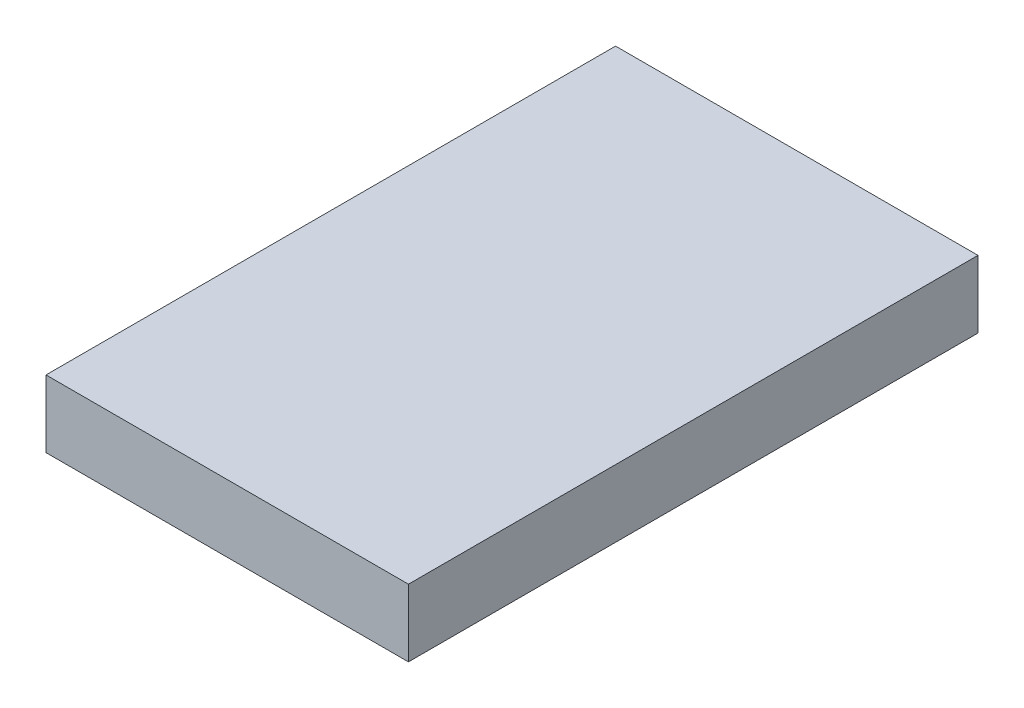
ISO-10303-21;
HEADER;
FILE_DESCRIPTION(('STEP AP214'),'2;1');
FILE_NAME('part.step','',(''),(''),'','','');
FILE_SCHEMA(('AUTOMOTIVE_DESIGN { 1 0 10303 214 1 1 1 1 }'));
ENDSEC;
DATA;
#1=APPLICATION_CONTEXT('core data for automotive mechanical design processes');
#2=APPLICATION_PROTOCOL_DEFINITION('international standard','automotive_design',2000,#1);
#3=PRODUCT_CONTEXT('',#1,'mechanical');
#4=PRODUCT('Part','Part','',(#3));
#5=PRODUCT_RELATED_PRODUCT_CATEGORY('part','',(#4));
#6=PRODUCT_DEFINITION_FORMATION('','',#4);
#7=PRODUCT_DEFINITION_CONTEXT('part definition',#1,'design');
#8=PRODUCT_DEFINITION('design','',#6,#7);
#9=PRODUCT_DEFINITION_SHAPE('','',#8);
#10=(LENGTH_UNIT() NAMED_UNIT(*) SI_UNIT(.MILLI.,.METRE.));
#11=(NAMED_UNIT(*) PLANE_ANGLE_UNIT() SI_UNIT($,.RADIAN.));
#12=(NAMED_UNIT(*) SI_UNIT($,.STERADIAN.) SOLID_ANGLE_UNIT());
#13=UNCERTAINTY_MEASURE_WITH_UNIT(LENGTH_MEASURE(1.E-05),#10,'distance_accuracy_value','');
#14=(GEOMETRIC_REPRESENTATION_CONTEXT(3) GLOBAL_UNCERTAINTY_ASSIGNED_CONTEXT((#13)) GLOBAL_UNIT_ASSIGNED_CONTEXT((#10,
#11,#12)) REPRESENTATION_CONTEXT('',''));
#15=CARTESIAN_POINT('',(0.,0.,0.));
#16=DIRECTION('',(0.,0.,1.));
#17=DIRECTION('',(1.,0.,0.));
#18=AXIS2_PLACEMENT_3D('',#15,#16,#17);
#19=CARTESIAN_POINT('',(-35.,13.,-55.));
#20=DIRECTION('',(1.,0.,0.));
#21=DIRECTION('',(0.,0.,-1.));
#22=AXIS2_PLACEMENT_3D('',#19,#20,#21);
#23=PLANE('',#22);
#24=DIRECTION('',(0.,0.,1.));
#25=VECTOR('',#24,1.);
#26=CARTESIAN_POINT('',(-35.,0.,-55.));
#27=LINE('',#26,#25);
#28=CARTESIAN_POINT('',(-35.,0.,-55.));
#29=VERTEX_POINT('',#28);
#30=CARTESIAN_POINT('',(-35.,0.,55.));
#31=VERTEX_POINT('',#30);
#32=EDGE_CURVE('E93',#29,#31,#27,.T.);
#33=ORIENTED_EDGE('',*,*,#32,.T.);
#34=DIRECTION('',(0.,-1.,0.));
#35=VECTOR('',#34,1.);
#36=CARTESIAN_POINT('',(-35.,13.,55.));
#37=LINE('',#36,#35);
#38=CARTESIAN_POINT('',(-35.,13.,55.));
#39=VERTEX_POINT('',#38);
#40=EDGE_CURVE('E11',#39,#31,#37,.T.);
#41=ORIENTED_EDGE('',*,*,#40,.F.);
#42=DIRECTION('',(0.,0.,1.));
#43=VECTOR('',#42,1.);
#44=CARTESIAN_POINT('',(-35.,13.,-55.));
#45=LINE('',#44,#43);
#46=CARTESIAN_POINT('',(-35.,13.,-55.));
#47=VERTEX_POINT('',#46);
#48=EDGE_CURVE('E81',#47,#39,#45,.T.);
#49=ORIENTED_EDGE('',*,*,#48,.F.);
#50=DIRECTION('',(0.,-1.,0.));
#51=VECTOR('',#50,1.);
#52=CARTESIAN_POINT('',(-35.,13.,-55.));
#53=LINE('',#52,#51);
#54=EDGE_CURVE('E89',#47,#29,#53,.T.);
#55=ORIENTED_EDGE('',*,*,#54,.T.);
#56=EDGE_LOOP('',(#33,#41,#49,#55));
#57=FACE_BOUND('',#56,.T.);
#58=ADVANCED_FACE('F30',(#57),#23,.F.);
#59=CARTESIAN_POINT('',(-35.,13.,55.));
#60=DIRECTION('',(0.,0.,-1.));
#61=DIRECTION('',(-1.,0.,0.));
#62=AXIS2_PLACEMENT_3D('',#59,#60,#61);
#63=PLANE('',#62);
#64=DIRECTION('',(1.,0.,0.));
#65=VECTOR('',#64,1.);
#66=CARTESIAN_POINT('',(-35.,0.,55.));
#67=LINE('',#66,#65);
#68=CARTESIAN_POINT('',(35.,0.,55.));
#69=VERTEX_POINT('',#68);
#70=EDGE_CURVE('E85',#31,#69,#67,.T.);
#71=ORIENTED_EDGE('',*,*,#70,.T.);
#72=DIRECTION('',(0.,-1.,0.));
#73=VECTOR('',#72,1.);
#74=CARTESIAN_POINT('',(35.,13.,55.));
#75=LINE('',#74,#73);
#76=CARTESIAN_POINT('',(35.,13.,55.));
#77=VERTEX_POINT('',#76);
#78=EDGE_CURVE('E38',#77,#69,#75,.T.);
#79=ORIENTED_EDGE('',*,*,#78,.F.);
#80=DIRECTION('',(1.,0.,0.));
#81=VECTOR('',#80,1.);
#82=CARTESIAN_POINT('',(-35.,13.,55.));
#83=LINE('',#82,#81);
#84=EDGE_CURVE('E76',#39,#77,#83,.T.);
#85=ORIENTED_EDGE('',*,*,#84,.F.);
#86=ORIENTED_EDGE('',*,*,#40,.T.);
#87=EDGE_LOOP('',(#71,#79,#85,#86));
#88=FACE_BOUND('',#87,.T.);
#89=ADVANCED_FACE('F84',(#88),#63,.F.);
#90=CARTESIAN_POINT('',(35.,13.,-55.));
#91=DIRECTION('',(-1.,0.,0.));
#92=DIRECTION('',(0.,0.,1.));
#93=AXIS2_PLACEMENT_3D('',#90,#91,#92);
#94=PLANE('',#93);
#95=DIRECTION('',(0.,0.,-1.));
#96=VECTOR('',#95,1.);
#97=CARTESIAN_POINT('',(35.,0.,-55.));
#98=LINE('',#97,#96);
#99=CARTESIAN_POINT('',(35.,0.,-55.));
#100=VERTEX_POINT('',#99);
#101=EDGE_CURVE('E63',#69,#100,#98,.T.);
#102=ORIENTED_EDGE('',*,*,#101,.T.);
#103=DIRECTION('',(0.,-1.,0.));
#104=VECTOR('',#103,1.);
#105=CARTESIAN_POINT('',(35.,13.,-55.));
#106=LINE('',#105,#104);
#107=CARTESIAN_POINT('',(35.,13.,-55.));
#108=VERTEX_POINT('',#107);
#109=EDGE_CURVE('E86',#108,#100,#106,.T.);
#110=ORIENTED_EDGE('',*,*,#109,.F.);
#111=DIRECTION('',(0.,0.,-1.));
#112=VECTOR('',#111,1.);
#113=CARTESIAN_POINT('',(35.,13.,-55.));
#114=LINE('',#113,#112);
#115=EDGE_CURVE('E79',#77,#108,#114,.T.);
#116=ORIENTED_EDGE('',*,*,#115,.F.);
#117=ORIENTED_EDGE('',*,*,#78,.T.);
#118=EDGE_LOOP('',(#102,#110,#116,#117));
#119=FACE_BOUND('',#118,.T.);
#120=ADVANCED_FACE('F87',(#119),#94,.F.);
#121=CARTESIAN_POINT('',(-35.,13.,-55.));
#122=DIRECTION('',(0.,0.,1.));
#123=DIRECTION('',(1.,0.,0.));
#124=AXIS2_PLACEMENT_3D('',#121,#122,#123);
#125=PLANE('',#124);
#126=DIRECTION('',(-1.,0.,0.));
#127=VECTOR('',#126,1.);
#128=CARTESIAN_POINT('',(-35.,0.,-55.));
#129=LINE('',#128,#127);
#130=EDGE_CURVE('E69',#100,#29,#129,.T.);
#131=ORIENTED_EDGE('',*,*,#130,.T.);
#132=ORIENTED_EDGE('',*,*,#54,.F.);
#133=DIRECTION('',(-1.,0.,0.));
#134=VECTOR('',#133,1.);
#135=CARTESIAN_POINT('',(-35.,13.,-55.));
#136=LINE('',#135,#134);
#137=EDGE_CURVE('E46',#108,#47,#136,.T.);
#138=ORIENTED_EDGE('',*,*,#137,.F.);
#139=ORIENTED_EDGE('',*,*,#109,.T.);
#140=EDGE_LOOP('',(#131,#132,#138,#139));
#141=FACE_BOUND('',#140,.T.);
#142=ADVANCED_FACE('F100',(#141),#125,.F.);
#143=CARTESIAN_POINT('',(-35.,13.,55.));
#144=DIRECTION('',(0.,1.,0.));
#145=DIRECTION('',(0.,0.,1.));
#146=AXIS2_PLACEMENT_3D('',#143,#144,#145);
#147=PLANE('',#146);
#148=ORIENTED_EDGE('',*,*,#48,.T.);
#149=ORIENTED_EDGE('',*,*,#84,.T.);
#150=ORIENTED_EDGE('',*,*,#115,.T.);
#151=ORIENTED_EDGE('',*,*,#137,.T.);
#152=EDGE_LOOP('',(#148,#149,#150,#151));
#153=FACE_BOUND('',#152,.T.);
#154=ADVANCED_FACE('F77',(#153),#147,.T.);
#155=CARTESIAN_POINT('',(-35.,0.,55.));
#156=DIRECTION('',(0.,1.,0.));
#157=DIRECTION('',(0.,0.,1.));
#158=AXIS2_PLACEMENT_3D('',#155,#156,#157);
#159=PLANE('',#158);
#160=ORIENTED_EDGE('',*,*,#32,.F.);
#161=ORIENTED_EDGE('',*,*,#130,.F.);
#162=ORIENTED_EDGE('',*,*,#101,.F.);
#163=ORIENTED_EDGE('',*,*,#70,.F.);
#164=EDGE_LOOP('',(#160,#161,#162,#163));
#165=FACE_BOUND('',#164,.T.);
#166=ADVANCED_FACE('F103',(#165),#159,.F.);
#167=CLOSED_SHELL('',(#58,#89,#120,#142,#154,#166));
#168=MANIFOLD_SOLID_BREP('B2',#167);
#169=ADVANCED_BREP_SHAPE_REPRESENTATION('',(#18,#168),#14);
#170=SHAPE_DEFINITION_REPRESENTATION(#9,#169);
ENDSEC;
END-ISO-10303-21;
